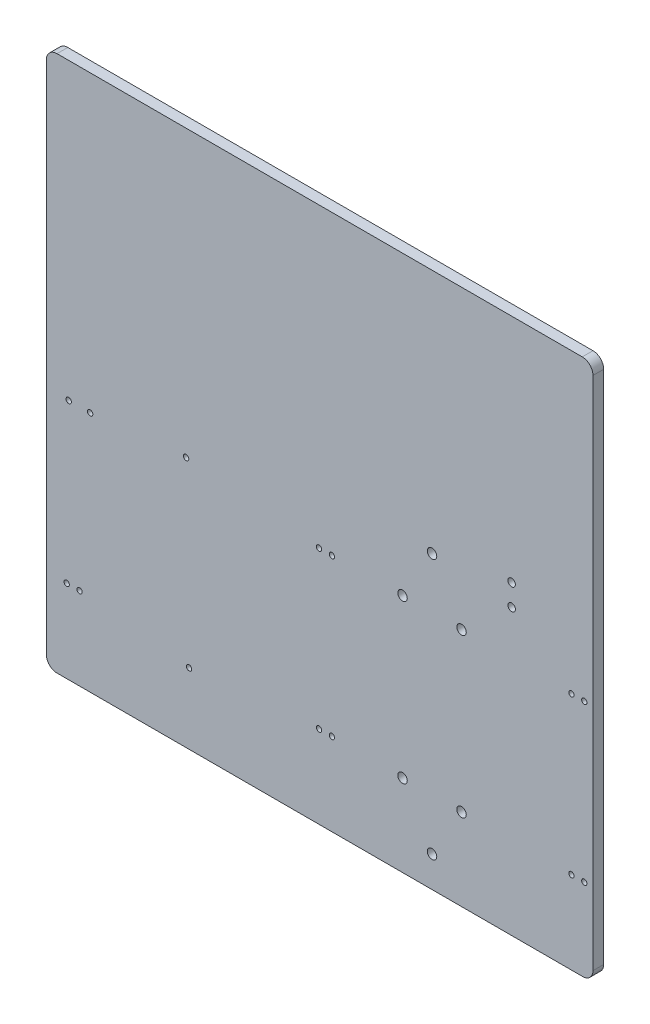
ISO-10303-21;
HEADER;
FILE_DESCRIPTION(('STEP AP214'),'2;1');
FILE_NAME('part.step','',(''),(''),'','','');
FILE_SCHEMA(('AUTOMOTIVE_DESIGN { 1 0 10303 214 1 1 1 1 }'));
ENDSEC;
DATA;
#1=APPLICATION_CONTEXT('core data for automotive mechanical design processes');
#2=APPLICATION_PROTOCOL_DEFINITION('international standard','automotive_design',2000,#1);
#3=PRODUCT_CONTEXT('',#1,'mechanical');
#4=PRODUCT('Part','Part','',(#3));
#5=PRODUCT_RELATED_PRODUCT_CATEGORY('part','',(#4));
#6=PRODUCT_DEFINITION_FORMATION('','',#4);
#7=PRODUCT_DEFINITION_CONTEXT('part definition',#1,'design');
#8=PRODUCT_DEFINITION('design','',#6,#7);
#9=PRODUCT_DEFINITION_SHAPE('','',#8);
#10=(LENGTH_UNIT() NAMED_UNIT(*) SI_UNIT(.MILLI.,.METRE.));
#11=(NAMED_UNIT(*) PLANE_ANGLE_UNIT() SI_UNIT($,.RADIAN.));
#12=(NAMED_UNIT(*) SI_UNIT($,.STERADIAN.) SOLID_ANGLE_UNIT());
#13=UNCERTAINTY_MEASURE_WITH_UNIT(LENGTH_MEASURE(1.E-05),#10,'distance_accuracy_value','');
#14=(GEOMETRIC_REPRESENTATION_CONTEXT(3) GLOBAL_UNCERTAINTY_ASSIGNED_CONTEXT((#13)) GLOBAL_UNIT_ASSIGNED_CONTEXT((#10,
#11,#12)) REPRESENTATION_CONTEXT('',''));
#15=CARTESIAN_POINT('',(0.,0.,0.));
#16=DIRECTION('',(0.,0.,1.));
#17=DIRECTION('',(1.,0.,0.));
#18=AXIS2_PLACEMENT_3D('',#15,#16,#17);
#19=CARTESIAN_POINT('',(50.8,0.,10.));
#20=DIRECTION('',(-1.,0.,0.));
#21=DIRECTION('',(0.,-1.,0.));
#22=AXIS2_PLACEMENT_3D('',#19,#20,#21);
#23=PLANE('',#22);
#24=DIRECTION('',(0.,1.,0.));
#25=VECTOR('',#24,1.);
#26=CARTESIAN_POINT('',(50.8,0.,0.));
#27=LINE('',#26,#25);
#28=CARTESIAN_POINT('',(50.8,9.525,0.));
#29=VERTEX_POINT('',#28);
#30=CARTESIAN_POINT('',(50.8,490.,0.));
#31=VERTEX_POINT('',#30);
#32=EDGE_CURVE('E200',#29,#31,#27,.T.);
#33=ORIENTED_EDGE('',*,*,#32,.T.);
#34=DIRECTION('',(0.,0.,-1.));
#35=VECTOR('',#34,1.);
#36=CARTESIAN_POINT('',(50.8,490.,10.));
#37=LINE('',#36,#35);
#38=CARTESIAN_POINT('',(50.8,490.,10.));
#39=VERTEX_POINT('',#38);
#40=EDGE_CURVE('E290',#31,#39,#37,.F.);
#41=ORIENTED_EDGE('',*,*,#40,.T.);
#42=DIRECTION('',(0.,1.,0.));
#43=VECTOR('',#42,1.);
#44=CARTESIAN_POINT('',(50.8,0.,10.));
#45=LINE('',#44,#43);
#46=CARTESIAN_POINT('',(50.8,9.525,10.));
#47=VERTEX_POINT('',#46);
#48=EDGE_CURVE('E278',#47,#39,#45,.T.);
#49=ORIENTED_EDGE('',*,*,#48,.F.);
#50=DIRECTION('',(0.,0.,-1.));
#51=VECTOR('',#50,1.);
#52=CARTESIAN_POINT('',(50.8,9.525,10.));
#53=LINE('',#52,#51);
#54=EDGE_CURVE('E117',#47,#29,#53,.T.);
#55=ORIENTED_EDGE('',*,*,#54,.T.);
#56=EDGE_LOOP('',(#33,#41,#49,#55));
#57=FACE_BOUND('',#56,.T.);
#58=ADVANCED_FACE('F41',(#57),#23,.F.);
#59=CARTESIAN_POINT('',(-1.11022302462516E-13,500.,10.));
#60=DIRECTION('',(0.,-1.,0.));
#61=DIRECTION('',(1.,0.,0.));
#62=AXIS2_PLACEMENT_3D('',#59,#60,#61);
#63=PLANE('',#62);
#64=DIRECTION('',(-1.,0.,0.));
#65=VECTOR('',#64,1.);
#66=CARTESIAN_POINT('',(-1.11022302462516E-13,500.,10.));
#67=LINE('',#66,#65);
#68=CARTESIAN_POINT('',(40.8,500.,10.));
#69=VERTEX_POINT('',#68);
#70=CARTESIAN_POINT('',(-448.725,500.,10.));
#71=VERTEX_POINT('',#70);
#72=EDGE_CURVE('E131',#69,#71,#67,.T.);
#73=ORIENTED_EDGE('',*,*,#72,.F.);
#74=DIRECTION('',(0.,0.,-1.));
#75=VECTOR('',#74,1.);
#76=CARTESIAN_POINT('',(40.8,500.,10.));
#77=LINE('',#76,#75);
#78=CARTESIAN_POINT('',(40.8,500.,0.));
#79=VERTEX_POINT('',#78);
#80=EDGE_CURVE('E281',#69,#79,#77,.T.);
#81=ORIENTED_EDGE('',*,*,#80,.T.);
#82=DIRECTION('',(-1.,0.,0.));
#83=VECTOR('',#82,1.);
#84=CARTESIAN_POINT('',(-1.11022302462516E-13,500.,0.));
#85=LINE('',#84,#83);
#86=CARTESIAN_POINT('',(-448.725,500.,0.));
#87=VERTEX_POINT('',#86);
#88=EDGE_CURVE('E203',#79,#87,#85,.T.);
#89=ORIENTED_EDGE('',*,*,#88,.T.);
#90=DIRECTION('',(0.,0.,-1.));
#91=VECTOR('',#90,1.);
#92=CARTESIAN_POINT('',(-448.725,500.,10.));
#93=LINE('',#92,#91);
#94=EDGE_CURVE('E116',#87,#71,#93,.F.);
#95=ORIENTED_EDGE('',*,*,#94,.T.);
#96=EDGE_LOOP('',(#73,#81,#89,#95));
#97=FACE_BOUND('',#96,.T.);
#98=ADVANCED_FACE('F316',(#97),#63,.F.);
#99=CARTESIAN_POINT('',(-458.725,0.,10.));
#100=DIRECTION('',(-1.,0.,0.));
#101=DIRECTION('',(0.,-1.,0.));
#102=AXIS2_PLACEMENT_3D('',#99,#100,#101);
#103=PLANE('',#102);
#104=DIRECTION('',(0.,1.,0.));
#105=VECTOR('',#104,1.);
#106=CARTESIAN_POINT('',(-458.725,0.,10.));
#107=LINE('',#106,#105);
#108=CARTESIAN_POINT('',(-458.725,9.99999999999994,10.));
#109=VERTEX_POINT('',#108);
#110=CARTESIAN_POINT('',(-458.725,490.,10.));
#111=VERTEX_POINT('',#110);
#112=EDGE_CURVE('E129',#109,#111,#107,.T.);
#113=ORIENTED_EDGE('',*,*,#112,.T.);
#114=DIRECTION('',(0.,0.,-1.));
#115=VECTOR('',#114,1.);
#116=CARTESIAN_POINT('',(-458.725,490.,0.));
#117=LINE('',#116,#115);
#118=CARTESIAN_POINT('',(-458.725,490.,0.));
#119=VERTEX_POINT('',#118);
#120=EDGE_CURVE('E49',#111,#119,#117,.T.);
#121=ORIENTED_EDGE('',*,*,#120,.T.);
#122=DIRECTION('',(0.,1.,0.));
#123=VECTOR('',#122,1.);
#124=CARTESIAN_POINT('',(-458.725,0.,0.));
#125=LINE('',#124,#123);
#126=CARTESIAN_POINT('',(-458.725,9.99999999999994,0.));
#127=VERTEX_POINT('',#126);
#128=EDGE_CURVE('E206',#127,#119,#125,.T.);
#129=ORIENTED_EDGE('',*,*,#128,.F.);
#130=DIRECTION('',(0.,0.,-1.));
#131=VECTOR('',#130,1.);
#132=CARTESIAN_POINT('',(-458.725,9.99999999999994,10.));
#133=LINE('',#132,#131);
#134=EDGE_CURVE('E296',#127,#109,#133,.F.);
#135=ORIENTED_EDGE('',*,*,#134,.T.);
#136=EDGE_LOOP('',(#113,#121,#129,#135));
#137=FACE_BOUND('',#136,.T.);
#138=ADVANCED_FACE('F301',(#137),#103,.T.);
#139=CARTESIAN_POINT('',(0.,0.,10.));
#140=DIRECTION('',(0.,-1.,0.));
#141=DIRECTION('',(1.,0.,0.));
#142=AXIS2_PLACEMENT_3D('',#139,#140,#141);
#143=PLANE('',#142);
#144=DIRECTION('',(-1.,0.,0.));
#145=VECTOR('',#144,1.);
#146=CARTESIAN_POINT('',(0.,0.,10.));
#147=LINE('',#146,#145);
#148=CARTESIAN_POINT('',(41.275,0.,10.));
#149=VERTEX_POINT('',#148);
#150=CARTESIAN_POINT('',(-448.725,0.,10.));
#151=VERTEX_POINT('',#150);
#152=EDGE_CURVE('E110',#149,#151,#147,.T.);
#153=ORIENTED_EDGE('',*,*,#152,.T.);
#154=DIRECTION('',(0.,0.,-1.));
#155=VECTOR('',#154,1.);
#156=CARTESIAN_POINT('',(-448.725,0.,10.));
#157=LINE('',#156,#155);
#158=CARTESIAN_POINT('',(-448.725,0.,0.));
#159=VERTEX_POINT('',#158);
#160=EDGE_CURVE('E11',#151,#159,#157,.T.);
#161=ORIENTED_EDGE('',*,*,#160,.T.);
#162=DIRECTION('',(-1.,0.,0.));
#163=VECTOR('',#162,1.);
#164=CARTESIAN_POINT('',(0.,0.,0.));
#165=LINE('',#164,#163);
#166=CARTESIAN_POINT('',(41.275,0.,0.));
#167=VERTEX_POINT('',#166);
#168=EDGE_CURVE('E113',#167,#159,#165,.T.);
#169=ORIENTED_EDGE('',*,*,#168,.F.);
#170=DIRECTION('',(0.,0.,-1.));
#171=VECTOR('',#170,1.);
#172=CARTESIAN_POINT('',(41.275,0.,10.));
#173=LINE('',#172,#171);
#174=EDGE_CURVE('E107',#149,#167,#173,.T.);
#175=ORIENTED_EDGE('',*,*,#174,.F.);
#176=EDGE_LOOP('',(#153,#161,#169,#175));
#177=FACE_BOUND('',#176,.T.);
#178=ADVANCED_FACE('F109',(#177),#143,.T.);
#179=CARTESIAN_POINT('',(-99.1999999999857,271.250000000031,10.));
#180=DIRECTION('',(0.,0.,-1.));
#181=DIRECTION('',(-1.,0.,0.));
#182=AXIS2_PLACEMENT_3D('',#179,#180,#181);
#183=CYLINDRICAL_SURFACE('',#182,4.40055);
#184=CARTESIAN_POINT('',(-99.1999999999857,271.250000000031,10.));
#185=DIRECTION('',(0.,0.,1.));
#186=DIRECTION('',(1.,0.,0.));
#187=AXIS2_PLACEMENT_3D('',#184,#185,#186);
#188=CIRCLE('',#187,4.40055);
#189=CARTESIAN_POINT('',(-94.7994499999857,271.250000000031,10.));
#190=VERTEX_POINT('',#189);
#191=EDGE_CURVE('E194',#190,#190,#188,.T.);
#192=ORIENTED_EDGE('',*,*,#191,.T.);
#193=EDGE_LOOP('',(#192));
#194=FACE_BOUND('',#193,.T.);
#195=CARTESIAN_POINT('',(-99.1999999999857,271.250000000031,0.));
#196=DIRECTION('',(0.,0.,1.));
#197=DIRECTION('',(1.,0.,0.));
#198=AXIS2_PLACEMENT_3D('',#195,#196,#197);
#199=CIRCLE('',#198,4.40055);
#200=CARTESIAN_POINT('',(-94.7994499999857,271.250000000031,0.));
#201=VERTEX_POINT('',#200);
#202=EDGE_CURVE('E272',#201,#201,#199,.T.);
#203=ORIENTED_EDGE('',*,*,#202,.F.);
#204=EDGE_LOOP('',(#203));
#205=FACE_BOUND('',#204,.T.);
#206=ADVANCED_FACE('F348',(#194,#205),#183,.F.);
#207=CARTESIAN_POINT('',(-126.696306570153,223.625000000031,10.));
#208=DIRECTION('',(0.,0.,-1.));
#209=DIRECTION('',(-1.,0.,0.));
#210=AXIS2_PLACEMENT_3D('',#207,#208,#209);
#211=CYLINDRICAL_SURFACE('',#210,4.40054999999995);
#212=CARTESIAN_POINT('',(-126.696306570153,223.625000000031,10.));
#213=DIRECTION('',(0.,0.,1.));
#214=DIRECTION('',(1.,0.,0.));
#215=AXIS2_PLACEMENT_3D('',#212,#213,#214);
#216=CIRCLE('',#215,4.40054999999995);
#217=CARTESIAN_POINT('',(-122.295756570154,223.625000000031,10.));
#218=VERTEX_POINT('',#217);
#219=EDGE_CURVE('E191',#218,#218,#216,.T.);
#220=ORIENTED_EDGE('',*,*,#219,.T.);
#221=EDGE_LOOP('',(#220));
#222=FACE_BOUND('',#221,.T.);
#223=CARTESIAN_POINT('',(-126.696306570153,223.625000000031,0.));
#224=DIRECTION('',(0.,0.,1.));
#225=DIRECTION('',(1.,0.,0.));
#226=AXIS2_PLACEMENT_3D('',#223,#224,#225);
#227=CIRCLE('',#226,4.40054999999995);
#228=CARTESIAN_POINT('',(-122.295756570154,223.625000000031,0.));
#229=VERTEX_POINT('',#228);
#230=EDGE_CURVE('E269',#229,#229,#227,.T.);
#231=ORIENTED_EDGE('',*,*,#230,.F.);
#232=EDGE_LOOP('',(#231));
#233=FACE_BOUND('',#232,.T.);
#234=ADVANCED_FACE('F351',(#222,#233),#211,.F.);
#235=CARTESIAN_POINT('',(-71.7036934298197,76.3750000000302,10.));
#236=DIRECTION('',(0.,0.,-1.));
#237=DIRECTION('',(-1.,0.,0.));
#238=AXIS2_PLACEMENT_3D('',#235,#236,#237);
#239=CYLINDRICAL_SURFACE('',#238,4.40054999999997);
#240=CARTESIAN_POINT('',(-71.7036934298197,76.3750000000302,10.));
#241=DIRECTION('',(0.,0.,1.));
#242=DIRECTION('',(1.,0.,0.));
#243=AXIS2_PLACEMENT_3D('',#240,#241,#242);
#244=CIRCLE('',#243,4.40054999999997);
#245=CARTESIAN_POINT('',(-67.3031434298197,76.3750000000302,10.));
#246=VERTEX_POINT('',#245);
#247=EDGE_CURVE('E188',#246,#246,#244,.T.);
#248=ORIENTED_EDGE('',*,*,#247,.T.);
#249=EDGE_LOOP('',(#248));
#250=FACE_BOUND('',#249,.T.);
#251=CARTESIAN_POINT('',(-71.7036934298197,76.3750000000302,0.));
#252=DIRECTION('',(0.,0.,1.));
#253=DIRECTION('',(1.,0.,0.));
#254=AXIS2_PLACEMENT_3D('',#251,#252,#253);
#255=CIRCLE('',#254,4.40054999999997);
#256=CARTESIAN_POINT('',(-67.3031434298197,76.3750000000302,0.));
#257=VERTEX_POINT('',#256);
#258=EDGE_CURVE('E266',#257,#257,#255,.T.);
#259=ORIENTED_EDGE('',*,*,#258,.F.);
#260=EDGE_LOOP('',(#259));
#261=FACE_BOUND('',#260,.T.);
#262=ADVANCED_FACE('F355',(#250,#261),#239,.F.);
#263=CARTESIAN_POINT('',(-99.1999999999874,28.7500000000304,10.));
#264=DIRECTION('',(0.,0.,-1.));
#265=DIRECTION('',(-1.,0.,0.));
#266=AXIS2_PLACEMENT_3D('',#263,#264,#265);
#267=CYLINDRICAL_SURFACE('',#266,4.40055);
#268=CARTESIAN_POINT('',(-99.1999999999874,28.7500000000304,10.));
#269=DIRECTION('',(0.,0.,1.));
#270=DIRECTION('',(1.,0.,0.));
#271=AXIS2_PLACEMENT_3D('',#268,#269,#270);
#272=CIRCLE('',#271,4.40055);
#273=CARTESIAN_POINT('',(-94.7994499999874,28.7500000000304,10.));
#274=VERTEX_POINT('',#273);
#275=EDGE_CURVE('E185',#274,#274,#272,.T.);
#276=ORIENTED_EDGE('',*,*,#275,.T.);
#277=EDGE_LOOP('',(#276));
#278=FACE_BOUND('',#277,.T.);
#279=CARTESIAN_POINT('',(-99.1999999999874,28.7500000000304,0.));
#280=DIRECTION('',(0.,0.,1.));
#281=DIRECTION('',(1.,0.,0.));
#282=AXIS2_PLACEMENT_3D('',#279,#280,#281);
#283=CIRCLE('',#282,4.40055);
#284=CARTESIAN_POINT('',(-94.7994499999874,28.7500000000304,0.));
#285=VERTEX_POINT('',#284);
#286=EDGE_CURVE('E263',#285,#285,#283,.T.);
#287=ORIENTED_EDGE('',*,*,#286,.F.);
#288=EDGE_LOOP('',(#287));
#289=FACE_BOUND('',#288,.T.);
#290=ADVANCED_FACE('F359',(#278,#289),#267,.F.);
#291=CARTESIAN_POINT('',(-126.696306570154,76.3750000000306,10.));
#292=DIRECTION('',(0.,0.,-1.));
#293=DIRECTION('',(-1.,0.,0.));
#294=AXIS2_PLACEMENT_3D('',#291,#292,#293);
#295=CYLINDRICAL_SURFACE('',#294,4.40054999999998);
#296=CARTESIAN_POINT('',(-126.696306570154,76.3750000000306,10.));
#297=DIRECTION('',(0.,0.,1.));
#298=DIRECTION('',(1.,0.,0.));
#299=AXIS2_PLACEMENT_3D('',#296,#297,#298);
#300=CIRCLE('',#299,4.40054999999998);
#301=CARTESIAN_POINT('',(-122.295756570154,76.3750000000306,10.));
#302=VERTEX_POINT('',#301);
#303=EDGE_CURVE('E182',#302,#302,#300,.T.);
#304=ORIENTED_EDGE('',*,*,#303,.T.);
#305=EDGE_LOOP('',(#304));
#306=FACE_BOUND('',#305,.T.);
#307=CARTESIAN_POINT('',(-126.696306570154,76.3750000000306,0.));
#308=DIRECTION('',(0.,0.,1.));
#309=DIRECTION('',(1.,0.,0.));
#310=AXIS2_PLACEMENT_3D('',#307,#308,#309);
#311=CIRCLE('',#310,4.40054999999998);
#312=CARTESIAN_POINT('',(-122.295756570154,76.3750000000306,0.));
#313=VERTEX_POINT('',#312);
#314=EDGE_CURVE('E260',#313,#313,#311,.T.);
#315=ORIENTED_EDGE('',*,*,#314,.F.);
#316=EDGE_LOOP('',(#315));
#317=FACE_BOUND('',#316,.T.);
#318=ADVANCED_FACE('F363',(#306,#317),#295,.F.);
#319=CARTESIAN_POINT('',(-437.868823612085,225.500000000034,10.));
#320=DIRECTION('',(0.,0.,-1.));
#321=DIRECTION('',(-1.,0.,0.));
#322=AXIS2_PLACEMENT_3D('',#319,#320,#321);
#323=CYLINDRICAL_SURFACE('',#322,2.48920000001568);
#324=CARTESIAN_POINT('',(-437.868823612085,225.500000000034,10.));
#325=DIRECTION('',(0.,0.,1.));
#326=DIRECTION('',(1.,0.,0.));
#327=AXIS2_PLACEMENT_3D('',#324,#325,#326);
#328=CIRCLE('',#327,2.48920000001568);
#329=CARTESIAN_POINT('',(-435.37962361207,225.500000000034,10.));
#330=VERTEX_POINT('',#329);
#331=EDGE_CURVE('E179',#330,#330,#328,.T.);
#332=ORIENTED_EDGE('',*,*,#331,.T.);
#333=EDGE_LOOP('',(#332));
#334=FACE_BOUND('',#333,.T.);
#335=CARTESIAN_POINT('',(-437.868823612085,225.500000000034,0.));
#336=DIRECTION('',(0.,0.,1.));
#337=DIRECTION('',(1.,0.,0.));
#338=AXIS2_PLACEMENT_3D('',#335,#336,#337);
#339=CIRCLE('',#338,2.48920000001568);
#340=CARTESIAN_POINT('',(-435.37962361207,225.500000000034,0.));
#341=VERTEX_POINT('',#340);
#342=EDGE_CURVE('E257',#341,#341,#339,.T.);
#343=ORIENTED_EDGE('',*,*,#342,.F.);
#344=EDGE_LOOP('',(#343));
#345=FACE_BOUND('',#344,.T.);
#346=ADVANCED_FACE('F367',(#334,#345),#323,.F.);
#347=CARTESIAN_POINT('',(-417.868823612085,225.500000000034,10.));
#348=DIRECTION('',(0.,0.,-1.));
#349=DIRECTION('',(-1.,0.,0.));
#350=AXIS2_PLACEMENT_3D('',#347,#348,#349);
#351=CYLINDRICAL_SURFACE('',#350,2.48920000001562);
#352=CARTESIAN_POINT('',(-417.868823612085,225.500000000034,10.));
#353=DIRECTION('',(0.,0.,1.));
#354=DIRECTION('',(1.,0.,0.));
#355=AXIS2_PLACEMENT_3D('',#352,#353,#354);
#356=CIRCLE('',#355,2.48920000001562);
#357=CARTESIAN_POINT('',(-415.37962361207,225.500000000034,10.));
#358=VERTEX_POINT('',#357);
#359=EDGE_CURVE('E176',#358,#358,#356,.T.);
#360=ORIENTED_EDGE('',*,*,#359,.T.);
#361=EDGE_LOOP('',(#360));
#362=FACE_BOUND('',#361,.T.);
#363=CARTESIAN_POINT('',(-417.868823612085,225.500000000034,0.));
#364=DIRECTION('',(0.,0.,1.));
#365=DIRECTION('',(1.,0.,0.));
#366=AXIS2_PLACEMENT_3D('',#363,#364,#365);
#367=CIRCLE('',#366,2.48920000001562);
#368=CARTESIAN_POINT('',(-415.37962361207,225.500000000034,0.));
#369=VERTEX_POINT('',#368);
#370=EDGE_CURVE('E254',#369,#369,#367,.T.);
#371=ORIENTED_EDGE('',*,*,#370,.F.);
#372=EDGE_LOOP('',(#371));
#373=FACE_BOUND('',#372,.T.);
#374=ADVANCED_FACE('F371',(#362,#373),#351,.F.);
#375=CARTESIAN_POINT('',(-439.725,76.9999999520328,10.));
#376=DIRECTION('',(0.,0.,-1.));
#377=DIRECTION('',(-1.,0.,0.));
#378=AXIS2_PLACEMENT_3D('',#375,#376,#377);
#379=CYLINDRICAL_SURFACE('',#378,2.48920000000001);
#380=CARTESIAN_POINT('',(-439.725,76.9999999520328,10.));
#381=DIRECTION('',(0.,0.,1.));
#382=DIRECTION('',(1.,0.,0.));
#383=AXIS2_PLACEMENT_3D('',#380,#381,#382);
#384=CIRCLE('',#383,2.48920000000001);
#385=CARTESIAN_POINT('',(-437.2358,76.9999999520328,10.));
#386=VERTEX_POINT('',#385);
#387=EDGE_CURVE('E173',#386,#386,#384,.T.);
#388=ORIENTED_EDGE('',*,*,#387,.T.);
#389=EDGE_LOOP('',(#388));
#390=FACE_BOUND('',#389,.T.);
#391=CARTESIAN_POINT('',(-439.725,76.9999999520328,0.));
#392=DIRECTION('',(0.,0.,1.));
#393=DIRECTION('',(1.,0.,0.));
#394=AXIS2_PLACEMENT_3D('',#391,#392,#393);
#395=CIRCLE('',#394,2.48920000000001);
#396=CARTESIAN_POINT('',(-437.2358,76.9999999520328,0.));
#397=VERTEX_POINT('',#396);
#398=EDGE_CURVE('E251',#397,#397,#395,.T.);
#399=ORIENTED_EDGE('',*,*,#398,.F.);
#400=EDGE_LOOP('',(#399));
#401=FACE_BOUND('',#400,.T.);
#402=ADVANCED_FACE('F375',(#390,#401),#379,.F.);
#403=CARTESIAN_POINT('',(-427.725,76.9999999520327,10.));
#404=DIRECTION('',(0.,0.,-1.));
#405=DIRECTION('',(-1.,0.,0.));
#406=AXIS2_PLACEMENT_3D('',#403,#404,#405);
#407=CYLINDRICAL_SURFACE('',#406,2.47649999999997);
#408=CARTESIAN_POINT('',(-427.725,76.9999999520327,10.));
#409=DIRECTION('',(0.,0.,1.));
#410=DIRECTION('',(1.,0.,0.));
#411=AXIS2_PLACEMENT_3D('',#408,#409,#410);
#412=CIRCLE('',#411,2.47649999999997);
#413=CARTESIAN_POINT('',(-425.2485,76.9999999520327,10.));
#414=VERTEX_POINT('',#413);
#415=EDGE_CURVE('E170',#414,#414,#412,.T.);
#416=ORIENTED_EDGE('',*,*,#415,.T.);
#417=EDGE_LOOP('',(#416));
#418=FACE_BOUND('',#417,.T.);
#419=CARTESIAN_POINT('',(-427.725,76.9999999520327,0.));
#420=DIRECTION('',(0.,0.,1.));
#421=DIRECTION('',(1.,0.,0.));
#422=AXIS2_PLACEMENT_3D('',#419,#420,#421);
#423=CIRCLE('',#422,2.47649999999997);
#424=CARTESIAN_POINT('',(-425.2485,76.9999999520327,0.));
#425=VERTEX_POINT('',#424);
#426=EDGE_CURVE('E248',#425,#425,#423,.T.);
#427=ORIENTED_EDGE('',*,*,#426,.F.);
#428=EDGE_LOOP('',(#427));
#429=FACE_BOUND('',#428,.T.);
#430=ADVANCED_FACE('F379',(#418,#429),#407,.F.);
#431=CARTESIAN_POINT('',(-204.50625,223.000000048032,10.));
#432=DIRECTION('',(0.,0.,-1.));
#433=DIRECTION('',(-1.,0.,0.));
#434=AXIS2_PLACEMENT_3D('',#431,#432,#433);
#435=CYLINDRICAL_SURFACE('',#434,2.47650000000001);
#436=CARTESIAN_POINT('',(-204.50625,223.000000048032,10.));
#437=DIRECTION('',(0.,0.,1.));
#438=DIRECTION('',(1.,0.,0.));
#439=AXIS2_PLACEMENT_3D('',#436,#437,#438);
#440=CIRCLE('',#439,2.47650000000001);
#441=CARTESIAN_POINT('',(-202.02975,223.000000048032,10.));
#442=VERTEX_POINT('',#441);
#443=EDGE_CURVE('E167',#442,#442,#440,.T.);
#444=ORIENTED_EDGE('',*,*,#443,.T.);
#445=EDGE_LOOP('',(#444));
#446=FACE_BOUND('',#445,.T.);
#447=CARTESIAN_POINT('',(-204.50625,223.000000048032,0.));
#448=DIRECTION('',(0.,0.,1.));
#449=DIRECTION('',(1.,0.,0.));
#450=AXIS2_PLACEMENT_3D('',#447,#448,#449);
#451=CIRCLE('',#450,2.47650000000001);
#452=CARTESIAN_POINT('',(-202.02975,223.000000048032,0.));
#453=VERTEX_POINT('',#452);
#454=EDGE_CURVE('E245',#453,#453,#451,.T.);
#455=ORIENTED_EDGE('',*,*,#454,.F.);
#456=EDGE_LOOP('',(#455));
#457=FACE_BOUND('',#456,.T.);
#458=ADVANCED_FACE('F383',(#446,#457),#435,.F.);
#459=CARTESIAN_POINT('',(-192.50625,223.000000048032,10.));
#460=DIRECTION('',(0.,0.,-1.));
#461=DIRECTION('',(-1.,0.,0.));
#462=AXIS2_PLACEMENT_3D('',#459,#460,#461);
#463=CYLINDRICAL_SURFACE('',#462,2.48920000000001);
#464=CARTESIAN_POINT('',(-192.50625,223.000000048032,10.));
#465=DIRECTION('',(0.,0.,1.));
#466=DIRECTION('',(1.,0.,0.));
#467=AXIS2_PLACEMENT_3D('',#464,#465,#466);
#468=CIRCLE('',#467,2.48920000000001);
#469=CARTESIAN_POINT('',(-190.01705,223.000000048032,10.));
#470=VERTEX_POINT('',#469);
#471=EDGE_CURVE('E164',#470,#470,#468,.T.);
#472=ORIENTED_EDGE('',*,*,#471,.T.);
#473=EDGE_LOOP('',(#472));
#474=FACE_BOUND('',#473,.T.);
#475=CARTESIAN_POINT('',(-192.50625,223.000000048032,0.));
#476=DIRECTION('',(0.,0.,1.));
#477=DIRECTION('',(1.,0.,0.));
#478=AXIS2_PLACEMENT_3D('',#475,#476,#477);
#479=CIRCLE('',#478,2.48920000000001);
#480=CARTESIAN_POINT('',(-190.01705,223.000000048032,0.));
#481=VERTEX_POINT('',#480);
#482=EDGE_CURVE('E242',#481,#481,#479,.T.);
#483=ORIENTED_EDGE('',*,*,#482,.F.);
#484=EDGE_LOOP('',(#483));
#485=FACE_BOUND('',#484,.T.);
#486=ADVANCED_FACE('F387',(#474,#485),#463,.F.);
#487=CARTESIAN_POINT('',(-204.506250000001,76.99999995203,10.));
#488=DIRECTION('',(0.,0.,-1.));
#489=DIRECTION('',(-1.,0.,0.));
#490=AXIS2_PLACEMENT_3D('',#487,#488,#489);
#491=CYLINDRICAL_SURFACE('',#490,2.4892);
#492=CARTESIAN_POINT('',(-204.506250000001,76.99999995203,10.));
#493=DIRECTION('',(0.,0.,1.));
#494=DIRECTION('',(1.,0.,0.));
#495=AXIS2_PLACEMENT_3D('',#492,#493,#494);
#496=CIRCLE('',#495,2.4892);
#497=CARTESIAN_POINT('',(-202.017050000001,76.99999995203,10.));
#498=VERTEX_POINT('',#497);
#499=EDGE_CURVE('E161',#498,#498,#496,.T.);
#500=ORIENTED_EDGE('',*,*,#499,.T.);
#501=EDGE_LOOP('',(#500));
#502=FACE_BOUND('',#501,.T.);
#503=CARTESIAN_POINT('',(-204.506250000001,76.99999995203,0.));
#504=DIRECTION('',(0.,0.,1.));
#505=DIRECTION('',(1.,0.,0.));
#506=AXIS2_PLACEMENT_3D('',#503,#504,#505);
#507=CIRCLE('',#506,2.4892);
#508=CARTESIAN_POINT('',(-202.017050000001,76.99999995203,0.));
#509=VERTEX_POINT('',#508);
#510=EDGE_CURVE('E239',#509,#509,#507,.T.);
#511=ORIENTED_EDGE('',*,*,#510,.F.);
#512=EDGE_LOOP('',(#511));
#513=FACE_BOUND('',#512,.T.);
#514=ADVANCED_FACE('F391',(#502,#513),#491,.F.);
#515=CARTESIAN_POINT('',(-192.506250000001,76.9999999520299,10.));
#516=DIRECTION('',(0.,0.,-1.));
#517=DIRECTION('',(-1.,0.,0.));
#518=AXIS2_PLACEMENT_3D('',#515,#516,#517);
#519=CYLINDRICAL_SURFACE('',#518,2.47650000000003);
#520=CARTESIAN_POINT('',(-192.506250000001,76.9999999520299,10.));
#521=DIRECTION('',(0.,0.,1.));
#522=DIRECTION('',(1.,0.,0.));
#523=AXIS2_PLACEMENT_3D('',#520,#521,#522);
#524=CIRCLE('',#523,2.47650000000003);
#525=CARTESIAN_POINT('',(-190.029750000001,76.9999999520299,10.));
#526=VERTEX_POINT('',#525);
#527=EDGE_CURVE('E158',#526,#526,#524,.T.);
#528=ORIENTED_EDGE('',*,*,#527,.T.);
#529=EDGE_LOOP('',(#528));
#530=FACE_BOUND('',#529,.T.);
#531=CARTESIAN_POINT('',(-192.506250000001,76.9999999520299,0.));
#532=DIRECTION('',(0.,0.,1.));
#533=DIRECTION('',(1.,0.,0.));
#534=AXIS2_PLACEMENT_3D('',#531,#532,#533);
#535=CIRCLE('',#534,2.47650000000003);
#536=CARTESIAN_POINT('',(-190.029750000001,76.9999999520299,0.));
#537=VERTEX_POINT('',#536);
#538=EDGE_CURVE('E236',#537,#537,#535,.T.);
#539=ORIENTED_EDGE('',*,*,#538,.F.);
#540=EDGE_LOOP('',(#539));
#541=FACE_BOUND('',#540,.T.);
#542=ADVANCED_FACE('F395',(#530,#541),#519,.F.);
#543=CARTESIAN_POINT('',(-325.652282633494,65.79999999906,10.));
#544=DIRECTION('',(0.,0.,-1.));
#545=DIRECTION('',(-1.,0.,0.));
#546=AXIS2_PLACEMENT_3D('',#543,#544,#545);
#547=CYLINDRICAL_SURFACE('',#546,2.48920000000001);
#548=CARTESIAN_POINT('',(-325.652282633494,65.79999999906,10.));
#549=DIRECTION('',(0.,0.,1.));
#550=DIRECTION('',(1.,0.,0.));
#551=AXIS2_PLACEMENT_3D('',#548,#549,#550);
#552=CIRCLE('',#551,2.48920000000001);
#553=CARTESIAN_POINT('',(-323.163082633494,65.79999999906,10.));
#554=VERTEX_POINT('',#553);
#555=EDGE_CURVE('E155',#554,#554,#552,.T.);
#556=ORIENTED_EDGE('',*,*,#555,.T.);
#557=EDGE_LOOP('',(#556));
#558=FACE_BOUND('',#557,.T.);
#559=CARTESIAN_POINT('',(-325.652282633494,65.79999999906,0.));
#560=DIRECTION('',(0.,0.,1.));
#561=DIRECTION('',(1.,0.,0.));
#562=AXIS2_PLACEMENT_3D('',#559,#560,#561);
#563=CIRCLE('',#562,2.48920000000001);
#564=CARTESIAN_POINT('',(-323.163082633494,65.79999999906,0.));
#565=VERTEX_POINT('',#564);
#566=EDGE_CURVE('E233',#565,#565,#563,.T.);
#567=ORIENTED_EDGE('',*,*,#566,.F.);
#568=EDGE_LOOP('',(#567));
#569=FACE_BOUND('',#568,.T.);
#570=ADVANCED_FACE('F399',(#558,#569),#547,.F.);
#571=CARTESIAN_POINT('',(30.7124999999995,76.9999999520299,10.));
#572=DIRECTION('',(0.,0.,-1.));
#573=DIRECTION('',(-1.,0.,0.));
#574=AXIS2_PLACEMENT_3D('',#571,#572,#573);
#575=CYLINDRICAL_SURFACE('',#574,2.4892);
#576=CARTESIAN_POINT('',(30.7124999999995,76.9999999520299,10.));
#577=DIRECTION('',(0.,0.,1.));
#578=DIRECTION('',(1.,0.,0.));
#579=AXIS2_PLACEMENT_3D('',#576,#577,#578);
#580=CIRCLE('',#579,2.4892);
#581=CARTESIAN_POINT('',(33.2016999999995,76.9999999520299,10.));
#582=VERTEX_POINT('',#581);
#583=EDGE_CURVE('E152',#582,#582,#580,.T.);
#584=ORIENTED_EDGE('',*,*,#583,.T.);
#585=EDGE_LOOP('',(#584));
#586=FACE_BOUND('',#585,.T.);
#587=CARTESIAN_POINT('',(30.7124999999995,76.9999999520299,0.));
#588=DIRECTION('',(0.,0.,1.));
#589=DIRECTION('',(1.,0.,0.));
#590=AXIS2_PLACEMENT_3D('',#587,#588,#589);
#591=CIRCLE('',#590,2.4892);
#592=CARTESIAN_POINT('',(33.2016999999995,76.9999999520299,0.));
#593=VERTEX_POINT('',#592);
#594=EDGE_CURVE('E230',#593,#593,#591,.T.);
#595=ORIENTED_EDGE('',*,*,#594,.F.);
#596=EDGE_LOOP('',(#595));
#597=FACE_BOUND('',#596,.T.);
#598=ADVANCED_FACE('F403',(#586,#597),#575,.F.);
#599=CARTESIAN_POINT('',(42.7125000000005,223.00000004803,10.));
#600=DIRECTION('',(0.,0.,-1.));
#601=DIRECTION('',(-1.,0.,0.));
#602=AXIS2_PLACEMENT_3D('',#599,#600,#601);
#603=CYLINDRICAL_SURFACE('',#602,2.4892);
#604=CARTESIAN_POINT('',(42.7125000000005,223.00000004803,10.));
#605=DIRECTION('',(0.,0.,1.));
#606=DIRECTION('',(1.,0.,0.));
#607=AXIS2_PLACEMENT_3D('',#604,#605,#606);
#608=CIRCLE('',#607,2.4892);
#609=CARTESIAN_POINT('',(45.2017000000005,223.00000004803,10.));
#610=VERTEX_POINT('',#609);
#611=EDGE_CURVE('E149',#610,#610,#608,.T.);
#612=ORIENTED_EDGE('',*,*,#611,.T.);
#613=EDGE_LOOP('',(#612));
#614=FACE_BOUND('',#613,.T.);
#615=CARTESIAN_POINT('',(42.7125000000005,223.00000004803,0.));
#616=DIRECTION('',(0.,0.,1.));
#617=DIRECTION('',(1.,0.,0.));
#618=AXIS2_PLACEMENT_3D('',#615,#616,#617);
#619=CIRCLE('',#618,2.4892);
#620=CARTESIAN_POINT('',(45.2017000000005,223.00000004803,0.));
#621=VERTEX_POINT('',#620);
#622=EDGE_CURVE('E227',#621,#621,#619,.T.);
#623=ORIENTED_EDGE('',*,*,#622,.F.);
#624=EDGE_LOOP('',(#623));
#625=FACE_BOUND('',#624,.T.);
#626=ADVANCED_FACE('F407',(#614,#625),#603,.F.);
#627=CARTESIAN_POINT('',(30.7125000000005,223.00000004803,10.));
#628=DIRECTION('',(0.,0.,-1.));
#629=DIRECTION('',(-1.,0.,0.));
#630=AXIS2_PLACEMENT_3D('',#627,#628,#629);
#631=CYLINDRICAL_SURFACE('',#630,2.47650000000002);
#632=CARTESIAN_POINT('',(30.7125000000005,223.00000004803,10.));
#633=DIRECTION('',(0.,0.,1.));
#634=DIRECTION('',(1.,0.,0.));
#635=AXIS2_PLACEMENT_3D('',#632,#633,#634);
#636=CIRCLE('',#635,2.47650000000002);
#637=CARTESIAN_POINT('',(33.1890000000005,223.00000004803,10.));
#638=VERTEX_POINT('',#637);
#639=EDGE_CURVE('E146',#638,#638,#636,.T.);
#640=ORIENTED_EDGE('',*,*,#639,.T.);
#641=EDGE_LOOP('',(#640));
#642=FACE_BOUND('',#641,.T.);
#643=CARTESIAN_POINT('',(30.7125000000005,223.00000004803,0.));
#644=DIRECTION('',(0.,0.,1.));
#645=DIRECTION('',(1.,0.,0.));
#646=AXIS2_PLACEMENT_3D('',#643,#644,#645);
#647=CIRCLE('',#646,2.47650000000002);
#648=CARTESIAN_POINT('',(33.1890000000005,223.00000004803,0.));
#649=VERTEX_POINT('',#648);
#650=EDGE_CURVE('E224',#649,#649,#647,.T.);
#651=ORIENTED_EDGE('',*,*,#650,.F.);
#652=EDGE_LOOP('',(#651));
#653=FACE_BOUND('',#652,.T.);
#654=ADVANCED_FACE('F411',(#642,#653),#631,.F.);
#655=CARTESIAN_POINT('',(-25.0000000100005,285.000000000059,10.));
#656=DIRECTION('',(0.,0.,-1.));
#657=DIRECTION('',(-1.,0.,0.));
#658=AXIS2_PLACEMENT_3D('',#655,#656,#657);
#659=CYLINDRICAL_SURFACE('',#658,3.5);
#660=CARTESIAN_POINT('',(-25.0000000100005,285.000000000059,10.));
#661=DIRECTION('',(0.,0.,1.));
#662=DIRECTION('',(1.,0.,0.));
#663=AXIS2_PLACEMENT_3D('',#660,#661,#662);
#664=CIRCLE('',#663,3.5);
#665=CARTESIAN_POINT('',(-21.5000000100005,285.000000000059,10.));
#666=VERTEX_POINT('',#665);
#667=EDGE_CURVE('E143',#666,#666,#664,.T.);
#668=ORIENTED_EDGE('',*,*,#667,.T.);
#669=EDGE_LOOP('',(#668));
#670=FACE_BOUND('',#669,.T.);
#671=CARTESIAN_POINT('',(-25.0000000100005,285.000000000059,0.));
#672=DIRECTION('',(0.,0.,1.));
#673=DIRECTION('',(1.,0.,0.));
#674=AXIS2_PLACEMENT_3D('',#671,#672,#673);
#675=CIRCLE('',#674,3.5);
#676=CARTESIAN_POINT('',(-21.5000000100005,285.000000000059,0.));
#677=VERTEX_POINT('',#676);
#678=EDGE_CURVE('E221',#677,#677,#675,.T.);
#679=ORIENTED_EDGE('',*,*,#678,.F.);
#680=EDGE_LOOP('',(#679));
#681=FACE_BOUND('',#680,.T.);
#682=ADVANCED_FACE('F415',(#670,#681),#659,.F.);
#683=CARTESIAN_POINT('',(-25.0000000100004,265.000000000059,10.));
#684=DIRECTION('',(0.,0.,-1.));
#685=DIRECTION('',(-1.,0.,0.));
#686=AXIS2_PLACEMENT_3D('',#683,#684,#685);
#687=CYLINDRICAL_SURFACE('',#686,3.49999999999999);
#688=CARTESIAN_POINT('',(-25.0000000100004,265.000000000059,10.));
#689=DIRECTION('',(0.,0.,1.));
#690=DIRECTION('',(1.,0.,0.));
#691=AXIS2_PLACEMENT_3D('',#688,#689,#690);
#692=CIRCLE('',#691,3.49999999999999);
#693=CARTESIAN_POINT('',(-21.5000000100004,265.000000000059,10.));
#694=VERTEX_POINT('',#693);
#695=EDGE_CURVE('E140',#694,#694,#692,.T.);
#696=ORIENTED_EDGE('',*,*,#695,.T.);
#697=EDGE_LOOP('',(#696));
#698=FACE_BOUND('',#697,.T.);
#699=CARTESIAN_POINT('',(-25.0000000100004,265.000000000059,0.));
#700=DIRECTION('',(0.,0.,1.));
#701=DIRECTION('',(1.,0.,0.));
#702=AXIS2_PLACEMENT_3D('',#699,#700,#701);
#703=CIRCLE('',#702,3.49999999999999);
#704=CARTESIAN_POINT('',(-21.5000000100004,265.000000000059,0.));
#705=VERTEX_POINT('',#704);
#706=EDGE_CURVE('E218',#705,#705,#703,.T.);
#707=ORIENTED_EDGE('',*,*,#706,.F.);
#708=EDGE_LOOP('',(#707));
#709=FACE_BOUND('',#708,.T.);
#710=ADVANCED_FACE('F419',(#698,#709),#687,.F.);
#711=CARTESIAN_POINT('',(-328.426497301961,234.19999999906,10.));
#712=DIRECTION('',(0.,0.,-1.));
#713=DIRECTION('',(-1.,0.,0.));
#714=AXIS2_PLACEMENT_3D('',#711,#712,#713);
#715=CYLINDRICAL_SURFACE('',#714,2.48920000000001);
#716=CARTESIAN_POINT('',(-328.426497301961,234.19999999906,10.));
#717=DIRECTION('',(0.,0.,1.));
#718=DIRECTION('',(1.,0.,0.));
#719=AXIS2_PLACEMENT_3D('',#716,#717,#718);
#720=CIRCLE('',#719,2.48920000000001);
#721=CARTESIAN_POINT('',(-325.937297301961,234.19999999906,10.));
#722=VERTEX_POINT('',#721);
#723=EDGE_CURVE('E137',#722,#722,#720,.T.);
#724=ORIENTED_EDGE('',*,*,#723,.T.);
#725=EDGE_LOOP('',(#724));
#726=FACE_BOUND('',#725,.T.);
#727=CARTESIAN_POINT('',(-328.426497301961,234.19999999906,0.));
#728=DIRECTION('',(0.,0.,1.));
#729=DIRECTION('',(1.,0.,0.));
#730=AXIS2_PLACEMENT_3D('',#727,#728,#729);
#731=CIRCLE('',#730,2.48920000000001);
#732=CARTESIAN_POINT('',(-325.937297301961,234.19999999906,0.));
#733=VERTEX_POINT('',#732);
#734=EDGE_CURVE('E215',#733,#733,#731,.T.);
#735=ORIENTED_EDGE('',*,*,#734,.F.);
#736=EDGE_LOOP('',(#735));
#737=FACE_BOUND('',#736,.T.);
#738=ADVANCED_FACE('F423',(#726,#737),#715,.F.);
#739=CARTESIAN_POINT('',(42.7124999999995,76.9999999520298,10.));
#740=DIRECTION('',(0.,0.,-1.));
#741=DIRECTION('',(-1.,0.,0.));
#742=AXIS2_PLACEMENT_3D('',#739,#740,#741);
#743=CYLINDRICAL_SURFACE('',#742,2.47650000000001);
#744=CARTESIAN_POINT('',(42.7124999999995,76.9999999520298,10.));
#745=DIRECTION('',(0.,0.,1.));
#746=DIRECTION('',(1.,0.,0.));
#747=AXIS2_PLACEMENT_3D('',#744,#745,#746);
#748=CIRCLE('',#747,2.47650000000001);
#749=CARTESIAN_POINT('',(45.1889999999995,76.9999999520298,10.));
#750=VERTEX_POINT('',#749);
#751=EDGE_CURVE('E125',#750,#750,#748,.T.);
#752=ORIENTED_EDGE('',*,*,#751,.T.);
#753=EDGE_LOOP('',(#752));
#754=FACE_BOUND('',#753,.T.);
#755=CARTESIAN_POINT('',(42.7124999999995,76.9999999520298,0.));
#756=DIRECTION('',(0.,0.,1.));
#757=DIRECTION('',(1.,0.,0.));
#758=AXIS2_PLACEMENT_3D('',#755,#756,#757);
#759=CIRCLE('',#758,2.47650000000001);
#760=CARTESIAN_POINT('',(45.1889999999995,76.9999999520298,0.));
#761=VERTEX_POINT('',#760);
#762=EDGE_CURVE('E212',#761,#761,#759,.T.);
#763=ORIENTED_EDGE('',*,*,#762,.F.);
#764=EDGE_LOOP('',(#763));
#765=FACE_BOUND('',#764,.T.);
#766=ADVANCED_FACE('F427',(#754,#765),#743,.F.);
#767=CARTESIAN_POINT('',(41.275,9.525,10.));
#768=DIRECTION('',(0.,0.,-1.));
#769=DIRECTION('',(-1.,0.,0.));
#770=AXIS2_PLACEMENT_3D('',#767,#768,#769);
#771=CYLINDRICAL_SURFACE('',#770,9.525);
#772=CARTESIAN_POINT('',(41.275,9.525,0.));
#773=DIRECTION('',(0.,0.,1.));
#774=DIRECTION('',(1.,0.,0.));
#775=AXIS2_PLACEMENT_3D('',#772,#773,#774);
#776=CIRCLE('',#775,9.525);
#777=EDGE_CURVE('E210',#167,#29,#776,.T.);
#778=ORIENTED_EDGE('',*,*,#777,.T.);
#779=ORIENTED_EDGE('',*,*,#54,.F.);
#780=CARTESIAN_POINT('',(41.275,9.525,10.));
#781=DIRECTION('',(0.,0.,1.));
#782=DIRECTION('',(1.,0.,0.));
#783=AXIS2_PLACEMENT_3D('',#780,#781,#782);
#784=CIRCLE('',#783,9.525);
#785=EDGE_CURVE('E120',#149,#47,#784,.T.);
#786=ORIENTED_EDGE('',*,*,#785,.F.);
#787=ORIENTED_EDGE('',*,*,#174,.T.);
#788=EDGE_LOOP('',(#778,#779,#786,#787));
#789=FACE_BOUND('',#788,.T.);
#790=ADVANCED_FACE('F121',(#789),#771,.T.);
#791=CARTESIAN_POINT('',(-71.7036934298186,223.62500000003,10.));
#792=DIRECTION('',(0.,0.,-1.));
#793=DIRECTION('',(-1.,0.,0.));
#794=AXIS2_PLACEMENT_3D('',#791,#792,#793);
#795=CYLINDRICAL_SURFACE('',#794,4.40054999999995);
#796=CARTESIAN_POINT('',(-71.7036934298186,223.62500000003,10.));
#797=DIRECTION('',(0.,0.,1.));
#798=DIRECTION('',(1.,0.,0.));
#799=AXIS2_PLACEMENT_3D('',#796,#797,#798);
#800=CIRCLE('',#799,4.40054999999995);
#801=CARTESIAN_POINT('',(-67.3031434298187,223.62500000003,10.));
#802=VERTEX_POINT('',#801);
#803=EDGE_CURVE('E197',#802,#802,#800,.T.);
#804=ORIENTED_EDGE('',*,*,#803,.T.);
#805=EDGE_LOOP('',(#804));
#806=FACE_BOUND('',#805,.T.);
#807=CARTESIAN_POINT('',(-71.7036934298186,223.62500000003,0.));
#808=DIRECTION('',(0.,0.,1.));
#809=DIRECTION('',(1.,0.,0.));
#810=AXIS2_PLACEMENT_3D('',#807,#808,#809);
#811=CIRCLE('',#810,4.40054999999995);
#812=CARTESIAN_POINT('',(-67.3031434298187,223.62500000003,0.));
#813=VERTEX_POINT('',#812);
#814=EDGE_CURVE('E275',#813,#813,#811,.T.);
#815=ORIENTED_EDGE('',*,*,#814,.F.);
#816=EDGE_LOOP('',(#815));
#817=FACE_BOUND('',#816,.T.);
#818=ADVANCED_FACE('F343',(#806,#817),#795,.F.);
#819=CARTESIAN_POINT('',(0.,0.,10.));
#820=DIRECTION('',(0.,0.,1.));
#821=DIRECTION('',(1.,0.,0.));
#822=AXIS2_PLACEMENT_3D('',#819,#820,#821);
#823=PLANE('',#822);
#824=ORIENTED_EDGE('',*,*,#48,.T.);
#825=CARTESIAN_POINT('',(40.8,490.,10.));
#826=DIRECTION('',(0.,0.,1.));
#827=DIRECTION('',(1.,0.,0.));
#828=AXIS2_PLACEMENT_3D('',#825,#826,#827);
#829=CIRCLE('',#828,10.);
#830=EDGE_CURVE('E294',#39,#69,#829,.T.);
#831=ORIENTED_EDGE('',*,*,#830,.T.);
#832=ORIENTED_EDGE('',*,*,#72,.T.);
#833=CARTESIAN_POINT('',(-448.725,490.,10.));
#834=DIRECTION('',(0.,0.,1.));
#835=DIRECTION('',(1.,0.,0.));
#836=AXIS2_PLACEMENT_3D('',#833,#834,#835);
#837=CIRCLE('',#836,10.);
#838=EDGE_CURVE('E62',#71,#111,#837,.T.);
#839=ORIENTED_EDGE('',*,*,#838,.T.);
#840=ORIENTED_EDGE('',*,*,#112,.F.);
#841=CARTESIAN_POINT('',(-448.725,9.99999999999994,10.));
#842=DIRECTION('',(0.,0.,1.));
#843=DIRECTION('',(1.,0.,0.));
#844=AXIS2_PLACEMENT_3D('',#841,#842,#843);
#845=CIRCLE('',#844,10.);
#846=EDGE_CURVE('E56',#109,#151,#845,.T.);
#847=ORIENTED_EDGE('',*,*,#846,.T.);
#848=ORIENTED_EDGE('',*,*,#152,.F.);
#849=ORIENTED_EDGE('',*,*,#785,.T.);
#850=EDGE_LOOP('',(#824,#831,#832,#839,#840,#847,#848,#849));
#851=FACE_BOUND('',#850,.T.);
#852=ORIENTED_EDGE('',*,*,#751,.F.);
#853=EDGE_LOOP('',(#852));
#854=FACE_BOUND('',#853,.T.);
#855=ORIENTED_EDGE('',*,*,#723,.F.);
#856=EDGE_LOOP('',(#855));
#857=FACE_BOUND('',#856,.T.);
#858=ORIENTED_EDGE('',*,*,#695,.F.);
#859=EDGE_LOOP('',(#858));
#860=FACE_BOUND('',#859,.T.);
#861=ORIENTED_EDGE('',*,*,#667,.F.);
#862=EDGE_LOOP('',(#861));
#863=FACE_BOUND('',#862,.T.);
#864=ORIENTED_EDGE('',*,*,#639,.F.);
#865=EDGE_LOOP('',(#864));
#866=FACE_BOUND('',#865,.T.);
#867=ORIENTED_EDGE('',*,*,#611,.F.);
#868=EDGE_LOOP('',(#867));
#869=FACE_BOUND('',#868,.T.);
#870=ORIENTED_EDGE('',*,*,#583,.F.);
#871=EDGE_LOOP('',(#870));
#872=FACE_BOUND('',#871,.T.);
#873=ORIENTED_EDGE('',*,*,#555,.F.);
#874=EDGE_LOOP('',(#873));
#875=FACE_BOUND('',#874,.T.);
#876=ORIENTED_EDGE('',*,*,#527,.F.);
#877=EDGE_LOOP('',(#876));
#878=FACE_BOUND('',#877,.T.);
#879=ORIENTED_EDGE('',*,*,#499,.F.);
#880=EDGE_LOOP('',(#879));
#881=FACE_BOUND('',#880,.T.);
#882=ORIENTED_EDGE('',*,*,#471,.F.);
#883=EDGE_LOOP('',(#882));
#884=FACE_BOUND('',#883,.T.);
#885=ORIENTED_EDGE('',*,*,#443,.F.);
#886=EDGE_LOOP('',(#885));
#887=FACE_BOUND('',#886,.T.);
#888=ORIENTED_EDGE('',*,*,#415,.F.);
#889=EDGE_LOOP('',(#888));
#890=FACE_BOUND('',#889,.T.);
#891=ORIENTED_EDGE('',*,*,#387,.F.);
#892=EDGE_LOOP('',(#891));
#893=FACE_BOUND('',#892,.T.);
#894=ORIENTED_EDGE('',*,*,#359,.F.);
#895=EDGE_LOOP('',(#894));
#896=FACE_BOUND('',#895,.T.);
#897=ORIENTED_EDGE('',*,*,#331,.F.);
#898=EDGE_LOOP('',(#897));
#899=FACE_BOUND('',#898,.T.);
#900=ORIENTED_EDGE('',*,*,#303,.F.);
#901=EDGE_LOOP('',(#900));
#902=FACE_BOUND('',#901,.T.);
#903=ORIENTED_EDGE('',*,*,#275,.F.);
#904=EDGE_LOOP('',(#903));
#905=FACE_BOUND('',#904,.T.);
#906=ORIENTED_EDGE('',*,*,#247,.F.);
#907=EDGE_LOOP('',(#906));
#908=FACE_BOUND('',#907,.T.);
#909=ORIENTED_EDGE('',*,*,#219,.F.);
#910=EDGE_LOOP('',(#909));
#911=FACE_BOUND('',#910,.T.);
#912=ORIENTED_EDGE('',*,*,#191,.F.);
#913=EDGE_LOOP('',(#912));
#914=FACE_BOUND('',#913,.T.);
#915=ORIENTED_EDGE('',*,*,#803,.F.);
#916=EDGE_LOOP('',(#915));
#917=FACE_BOUND('',#916,.T.);
#918=ADVANCED_FACE('F127',(#851,#854,#857,#860,#863,#866,#869,#872,#875,#878,#881,#884,#887,
#890,#893,#896,#899,#902,#905,#908,#911,#914,#917),#823,.T.);
#919=CARTESIAN_POINT('',(0.,0.,0.));
#920=DIRECTION('',(0.,0.,1.));
#921=DIRECTION('',(1.,0.,0.));
#922=AXIS2_PLACEMENT_3D('',#919,#920,#921);
#923=PLANE('',#922);
#924=ORIENTED_EDGE('',*,*,#88,.F.);
#925=CARTESIAN_POINT('',(40.8,490.,0.));
#926=DIRECTION('',(0.,0.,1.));
#927=DIRECTION('',(1.,0.,0.));
#928=AXIS2_PLACEMENT_3D('',#925,#926,#927);
#929=CIRCLE('',#928,10.);
#930=EDGE_CURVE('E288',#79,#31,#929,.F.);
#931=ORIENTED_EDGE('',*,*,#930,.T.);
#932=ORIENTED_EDGE('',*,*,#32,.F.);
#933=ORIENTED_EDGE('',*,*,#777,.F.);
#934=ORIENTED_EDGE('',*,*,#168,.T.);
#935=CARTESIAN_POINT('',(-448.725,9.99999999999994,0.));
#936=DIRECTION('',(0.,0.,1.));
#937=DIRECTION('',(1.,0.,0.));
#938=AXIS2_PLACEMENT_3D('',#935,#936,#937);
#939=CIRCLE('',#938,10.);
#940=EDGE_CURVE('E284',#159,#127,#939,.F.);
#941=ORIENTED_EDGE('',*,*,#940,.T.);
#942=ORIENTED_EDGE('',*,*,#128,.T.);
#943=CARTESIAN_POINT('',(-448.725,490.,0.));
#944=DIRECTION('',(0.,0.,1.));
#945=DIRECTION('',(1.,0.,0.));
#946=AXIS2_PLACEMENT_3D('',#943,#944,#945);
#947=CIRCLE('',#946,10.);
#948=EDGE_CURVE('E286',#119,#87,#947,.F.);
#949=ORIENTED_EDGE('',*,*,#948,.T.);
#950=EDGE_LOOP('',(#924,#931,#932,#933,#934,#941,#942,#949));
#951=FACE_BOUND('',#950,.T.);
#952=ORIENTED_EDGE('',*,*,#762,.T.);
#953=EDGE_LOOP('',(#952));
#954=FACE_BOUND('',#953,.T.);
#955=ORIENTED_EDGE('',*,*,#734,.T.);
#956=EDGE_LOOP('',(#955));
#957=FACE_BOUND('',#956,.T.);
#958=ORIENTED_EDGE('',*,*,#706,.T.);
#959=EDGE_LOOP('',(#958));
#960=FACE_BOUND('',#959,.T.);
#961=ORIENTED_EDGE('',*,*,#678,.T.);
#962=EDGE_LOOP('',(#961));
#963=FACE_BOUND('',#962,.T.);
#964=ORIENTED_EDGE('',*,*,#650,.T.);
#965=EDGE_LOOP('',(#964));
#966=FACE_BOUND('',#965,.T.);
#967=ORIENTED_EDGE('',*,*,#622,.T.);
#968=EDGE_LOOP('',(#967));
#969=FACE_BOUND('',#968,.T.);
#970=ORIENTED_EDGE('',*,*,#594,.T.);
#971=EDGE_LOOP('',(#970));
#972=FACE_BOUND('',#971,.T.);
#973=ORIENTED_EDGE('',*,*,#566,.T.);
#974=EDGE_LOOP('',(#973));
#975=FACE_BOUND('',#974,.T.);
#976=ORIENTED_EDGE('',*,*,#538,.T.);
#977=EDGE_LOOP('',(#976));
#978=FACE_BOUND('',#977,.T.);
#979=ORIENTED_EDGE('',*,*,#510,.T.);
#980=EDGE_LOOP('',(#979));
#981=FACE_BOUND('',#980,.T.);
#982=ORIENTED_EDGE('',*,*,#482,.T.);
#983=EDGE_LOOP('',(#982));
#984=FACE_BOUND('',#983,.T.);
#985=ORIENTED_EDGE('',*,*,#454,.T.);
#986=EDGE_LOOP('',(#985));
#987=FACE_BOUND('',#986,.T.);
#988=ORIENTED_EDGE('',*,*,#426,.T.);
#989=EDGE_LOOP('',(#988));
#990=FACE_BOUND('',#989,.T.);
#991=ORIENTED_EDGE('',*,*,#398,.T.);
#992=EDGE_LOOP('',(#991));
#993=FACE_BOUND('',#992,.T.);
#994=ORIENTED_EDGE('',*,*,#370,.T.);
#995=EDGE_LOOP('',(#994));
#996=FACE_BOUND('',#995,.T.);
#997=ORIENTED_EDGE('',*,*,#342,.T.);
#998=EDGE_LOOP('',(#997));
#999=FACE_BOUND('',#998,.T.);
#1000=ORIENTED_EDGE('',*,*,#314,.T.);
#1001=EDGE_LOOP('',(#1000));
#1002=FACE_BOUND('',#1001,.T.);
#1003=ORIENTED_EDGE('',*,*,#286,.T.);
#1004=EDGE_LOOP('',(#1003));
#1005=FACE_BOUND('',#1004,.T.);
#1006=ORIENTED_EDGE('',*,*,#258,.T.);
#1007=EDGE_LOOP('',(#1006));
#1008=FACE_BOUND('',#1007,.T.);
#1009=ORIENTED_EDGE('',*,*,#230,.T.);
#1010=EDGE_LOOP('',(#1009));
#1011=FACE_BOUND('',#1010,.T.);
#1012=ORIENTED_EDGE('',*,*,#202,.T.);
#1013=EDGE_LOOP('',(#1012));
#1014=FACE_BOUND('',#1013,.T.);
#1015=ORIENTED_EDGE('',*,*,#814,.T.);
#1016=EDGE_LOOP('',(#1015));
#1017=FACE_BOUND('',#1016,.T.);
#1018=ADVANCED_FACE('F306',(#951,#954,#957,#960,#963,#966,#969,#972,#975,#978,#981,#984,#987,
#990,#993,#996,#999,#1002,#1005,#1008,#1011,#1014,#1017),#923,.F.);
#1019=CARTESIAN_POINT('',(40.8,490.,10.));
#1020=DIRECTION('',(0.,0.,-1.));
#1021=DIRECTION('',(-1.,0.,0.));
#1022=AXIS2_PLACEMENT_3D('',#1019,#1020,#1021);
#1023=CYLINDRICAL_SURFACE('',#1022,10.);
#1024=ORIENTED_EDGE('',*,*,#830,.F.);
#1025=ORIENTED_EDGE('',*,*,#40,.F.);
#1026=ORIENTED_EDGE('',*,*,#930,.F.);
#1027=ORIENTED_EDGE('',*,*,#80,.F.);
#1028=EDGE_LOOP('',(#1024,#1025,#1026,#1027));
#1029=FACE_BOUND('',#1028,.T.);
#1030=ADVANCED_FACE('F314',(#1029),#1023,.T.);
#1031=CARTESIAN_POINT('',(-448.725,490.,10.));
#1032=DIRECTION('',(0.,0.,1.));
#1033=DIRECTION('',(1.,0.,0.));
#1034=AXIS2_PLACEMENT_3D('',#1031,#1032,#1033);
#1035=CYLINDRICAL_SURFACE('',#1034,10.);
#1036=ORIENTED_EDGE('',*,*,#838,.F.);
#1037=ORIENTED_EDGE('',*,*,#94,.F.);
#1038=ORIENTED_EDGE('',*,*,#948,.F.);
#1039=ORIENTED_EDGE('',*,*,#120,.F.);
#1040=EDGE_LOOP('',(#1036,#1037,#1038,#1039));
#1041=FACE_BOUND('',#1040,.T.);
#1042=ADVANCED_FACE('F310',(#1041),#1035,.T.);
#1043=CARTESIAN_POINT('',(-448.725,9.99999999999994,10.));
#1044=DIRECTION('',(0.,0.,-1.));
#1045=DIRECTION('',(-1.,0.,0.));
#1046=AXIS2_PLACEMENT_3D('',#1043,#1044,#1045);
#1047=CYLINDRICAL_SURFACE('',#1046,10.);
#1048=ORIENTED_EDGE('',*,*,#846,.F.);
#1049=ORIENTED_EDGE('',*,*,#134,.F.);
#1050=ORIENTED_EDGE('',*,*,#940,.F.);
#1051=ORIENTED_EDGE('',*,*,#160,.F.);
#1052=EDGE_LOOP('',(#1048,#1049,#1050,#1051));
#1053=FACE_BOUND('',#1052,.T.);
#1054=ADVANCED_FACE('F43',(#1053),#1047,.T.);
#1055=CLOSED_SHELL('',(#58,#98,#138,#178,#206,#234,#262,#290,#318,#346,#374,#402,#430,#458,#486,
#514,#542,#570,#598,#626,#654,#682,#710,#738,#766,#790,#818,#918,#1018,#1030,#1042,#1054));
#1056=MANIFOLD_SOLID_BREP('B2',#1055);
#1057=ADVANCED_BREP_SHAPE_REPRESENTATION('',(#18,#1056),#14);
#1058=SHAPE_DEFINITION_REPRESENTATION(#9,#1057);
ENDSEC;
END-ISO-10303-21;
